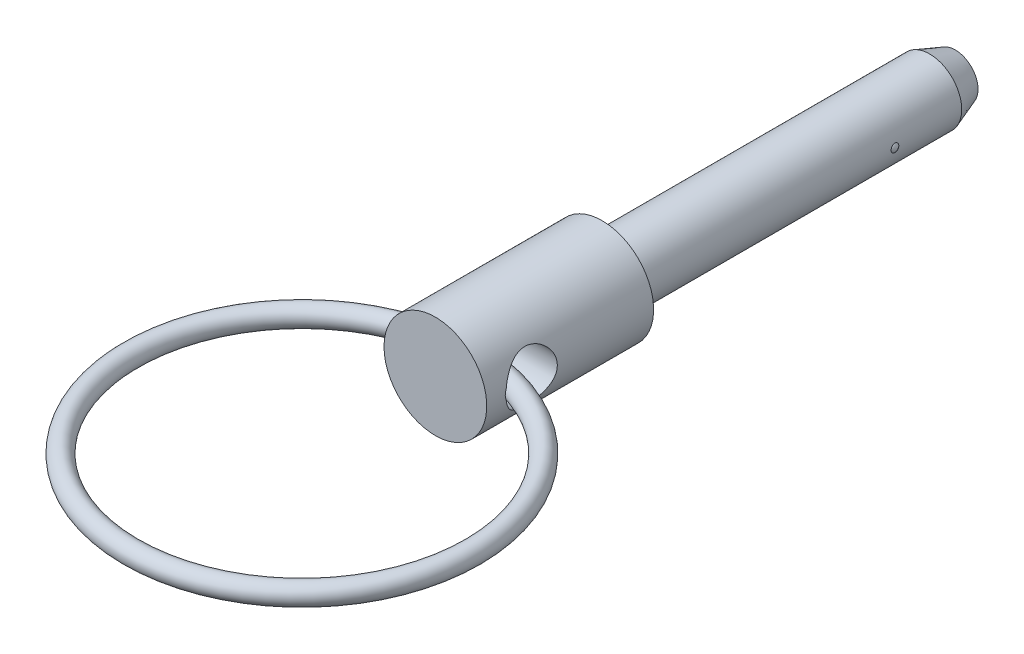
ISO-10303-21;
HEADER;
FILE_DESCRIPTION(('STEP AP214'),'2;1');
FILE_NAME('part.step','',(''),(''),'','','');
FILE_SCHEMA(('AUTOMOTIVE_DESIGN { 1 0 10303 214 1 1 1 1 }'));
ENDSEC;
DATA;
#1=APPLICATION_CONTEXT('core data for automotive mechanical design processes');
#2=APPLICATION_PROTOCOL_DEFINITION('international standard','automotive_design',2000,#1);
#3=PRODUCT_CONTEXT('',#1,'mechanical');
#4=PRODUCT('Part','Part','',(#3));
#5=PRODUCT_RELATED_PRODUCT_CATEGORY('part','',(#4));
#6=PRODUCT_DEFINITION_FORMATION('','',#4);
#7=PRODUCT_DEFINITION_CONTEXT('part definition',#1,'design');
#8=PRODUCT_DEFINITION('design','',#6,#7);
#9=PRODUCT_DEFINITION_SHAPE('','',#8);
#10=(LENGTH_UNIT() NAMED_UNIT(*) SI_UNIT(.MILLI.,.METRE.));
#11=(NAMED_UNIT(*) PLANE_ANGLE_UNIT() SI_UNIT($,.RADIAN.));
#12=(NAMED_UNIT(*) SI_UNIT($,.STERADIAN.) SOLID_ANGLE_UNIT());
#13=UNCERTAINTY_MEASURE_WITH_UNIT(LENGTH_MEASURE(1.E-05),#10,'distance_accuracy_value','');
#14=(GEOMETRIC_REPRESENTATION_CONTEXT(3) GLOBAL_UNCERTAINTY_ASSIGNED_CONTEXT((#13)) GLOBAL_UNIT_ASSIGNED_CONTEXT((#10,
#11,#12)) REPRESENTATION_CONTEXT('',''));
#15=CARTESIAN_POINT('',(0.,0.,0.));
#16=DIRECTION('',(0.,0.,1.));
#17=DIRECTION('',(1.,0.,0.));
#18=AXIS2_PLACEMENT_3D('',#15,#16,#17);
#19=CARTESIAN_POINT('',(0.,0.,14.9758741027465));
#20=DIRECTION('',(0.,0.,1.));
#21=DIRECTION('',(-1.,0.,0.));
#22=AXIS2_PLACEMENT_3D('',#19,#20,#21);
#23=CYLINDRICAL_SURFACE('',#22,4.00000000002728);
#24=CARTESIAN_POINT('',(0.,0.,12.9999999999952));
#25=DIRECTION('',(0.,0.,1.));
#26=DIRECTION('',(-1.,0.,0.));
#27=AXIS2_PLACEMENT_3D('',#24,#25,#26);
#28=CIRCLE('',#27,4.00000000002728);
#29=CARTESIAN_POINT('',(-4.00000000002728,0.,12.9999999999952));
#30=VERTEX_POINT('',#29);
#31=EDGE_CURVE('E68',#30,#30,#28,.T.);
#32=ORIENTED_EDGE('',*,*,#31,.F.);
#33=EDGE_LOOP('',(#32));
#34=FACE_BOUND('',#33,.T.);
#35=CARTESIAN_POINT('',(0.,0.,2.90531487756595E-11));
#36=DIRECTION('',(0.,0.,1.));
#37=DIRECTION('',(-1.,0.,0.));
#38=AXIS2_PLACEMENT_3D('',#35,#36,#37);
#39=CIRCLE('',#38,4.00000000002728);
#40=CARTESIAN_POINT('',(-4.00000000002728,0.,2.90531487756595E-11));
#41=VERTEX_POINT('',#40);
#42=EDGE_CURVE('E119',#41,#41,#39,.T.);
#43=ORIENTED_EDGE('',*,*,#42,.T.);
#44=EDGE_LOOP('',(#43));
#45=FACE_BOUND('',#44,.T.);
#46=CARTESIAN_POINT('',(3.99005038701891,0.281953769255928,9.92986493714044));
#47=CARTESIAN_POINT('',(3.98710361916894,0.323646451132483,9.94537015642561));
#48=CARTESIAN_POINT('',(3.98358785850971,0.364031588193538,9.96435084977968));
#49=CARTESIAN_POINT('',(3.97580260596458,0.441017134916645,10.008790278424));
#50=CARTESIAN_POINT('',(3.97153248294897,0.477614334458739,10.0342544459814));
#51=CARTESIAN_POINT('',(3.96271650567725,0.545954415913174,10.0909789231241));
#52=CARTESIAN_POINT('',(3.95817071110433,0.577698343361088,10.1222379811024));
#53=CARTESIAN_POINT('',(3.94931125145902,0.635450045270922,10.1896824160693));
#54=CARTESIAN_POINT('',(3.94499753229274,0.661459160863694,10.2258666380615));
#55=CARTESIAN_POINT('',(3.93708131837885,0.707055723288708,10.3020868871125));
#56=CARTESIAN_POINT('',(3.93347801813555,0.726650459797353,10.3421184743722));
#57=CARTESIAN_POINT('',(3.92735611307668,0.759043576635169,10.4249158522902));
#58=CARTESIAN_POINT('',(3.92483759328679,0.771841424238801,10.4676818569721));
#59=CARTESIAN_POINT('',(3.92109281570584,0.79064892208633,10.5555243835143));
#60=CARTESIAN_POINT('',(3.91989028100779,0.796534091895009,10.6006284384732));
#61=CARTESIAN_POINT('',(3.91894269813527,0.801182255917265,10.6912124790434));
#62=CARTESIAN_POINT('',(3.91919799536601,0.799943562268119,10.7366925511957));
#63=CARTESIAN_POINT('',(3.92114297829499,0.790356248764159,10.829192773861));
#64=CARTESIAN_POINT('',(3.92290466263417,0.781650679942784,10.8761742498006));
#65=CARTESIAN_POINT('',(3.92772482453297,0.757055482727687,10.9681516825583));
#66=CARTESIAN_POINT('',(3.93078377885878,0.741163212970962,11.0131469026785));
#67=CARTESIAN_POINT('',(3.93806499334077,0.70148030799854,11.1026764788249));
#68=CARTESIAN_POINT('',(3.94234583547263,0.677274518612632,11.1470226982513));
#69=CARTESIAN_POINT('',(3.95147153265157,0.621820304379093,11.2310343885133));
#70=CARTESIAN_POINT('',(3.95631656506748,0.590569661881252,11.2706983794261));
#71=CARTESIAN_POINT('',(3.9660181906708,0.521460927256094,11.3441933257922));
#72=CARTESIAN_POINT('',(3.97087472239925,0.483570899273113,11.3779944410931));
#73=CARTESIAN_POINT('',(3.97994547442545,0.402125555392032,11.4380257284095));
#74=CARTESIAN_POINT('',(3.98416017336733,0.358574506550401,11.4642615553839));
#75=CARTESIAN_POINT('',(3.99101820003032,0.271145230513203,11.5057266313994));
#76=CARTESIAN_POINT('',(3.99376828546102,0.227643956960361,11.5217298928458));
#77=CARTESIAN_POINT('',(3.9978554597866,0.138347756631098,11.5452375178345));
#78=CARTESIAN_POINT('',(3.99919394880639,0.0925551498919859,11.5527503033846));
#79=CARTESIAN_POINT('',(4.00020492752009,0.00564920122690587,11.5584330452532));
#80=CARTESIAN_POINT('',(4.00005022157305,-0.0354012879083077,11.5575719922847));
#81=CARTESIAN_POINT('',(3.99850330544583,-0.116721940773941,11.5488508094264));
#82=CARTESIAN_POINT('',(3.99711125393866,-0.156992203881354,11.5409915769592));
#83=CARTESIAN_POINT('',(3.99330536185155,-0.234470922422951,11.5190218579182));
#84=CARTESIAN_POINT('',(3.99092186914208,-0.271733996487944,11.5050965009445));
#85=CARTESIAN_POINT('',(3.98537855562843,-0.343596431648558,11.4716692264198));
#86=CARTESIAN_POINT('',(3.98221855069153,-0.378195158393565,11.4521659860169));
#87=CARTESIAN_POINT('',(3.97515535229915,-0.446551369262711,11.4066625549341));
#88=CARTESIAN_POINT('',(3.97121432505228,-0.48005403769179,11.380286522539));
#89=CARTESIAN_POINT('',(3.96314004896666,-0.542697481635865,11.3228119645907));
#90=CARTESIAN_POINT('',(3.95900671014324,-0.57183618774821,11.2917112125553));
#91=CARTESIAN_POINT('',(3.95044956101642,-0.628376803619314,11.2218573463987));
#92=CARTESIAN_POINT('',(3.94604615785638,-0.655204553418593,11.1826362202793));
#93=CARTESIAN_POINT('',(3.93791011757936,-0.702452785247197,11.1004353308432));
#94=CARTESIAN_POINT('',(3.93417778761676,-0.72287033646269,11.0574538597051));
#95=CARTESIAN_POINT('',(3.92755557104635,-0.758058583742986,10.9655943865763));
#96=CARTESIAN_POINT('',(3.92474503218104,-0.772320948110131,10.9165145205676));
#97=CARTESIAN_POINT('',(3.92073635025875,-0.792422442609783,10.8165862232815));
#98=CARTESIAN_POINT('',(3.91953811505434,-0.79826205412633,10.765737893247));
#99=CARTESIAN_POINT('',(3.91896964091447,-0.801049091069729,10.6645522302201));
#100=CARTESIAN_POINT('',(3.91957166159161,-0.798131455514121,10.6142190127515));
#101=CARTESIAN_POINT('',(3.92252995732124,-0.783463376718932,10.5149080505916));
#102=CARTESIAN_POINT('',(3.9248854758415,-0.771716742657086,10.4659297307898));
#103=CARTESIAN_POINT('',(3.93088557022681,-0.740520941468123,10.3740211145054));
#104=CARTESIAN_POINT('',(3.93443961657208,-0.721603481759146,10.3309041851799));
#105=CARTESIAN_POINT('',(3.94243966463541,-0.67652841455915,10.2487285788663));
#106=CARTESIAN_POINT('',(3.94688545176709,-0.650372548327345,10.2096689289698));
#107=CARTESIAN_POINT('',(3.95592540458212,-0.592842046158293,10.138445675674));
#108=CARTESIAN_POINT('',(3.96050463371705,-0.561744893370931,10.1060555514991));
#109=CARTESIAN_POINT('',(3.96946431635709,-0.494471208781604,10.0470379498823));
#110=CARTESIAN_POINT('',(3.97384478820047,-0.458295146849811,10.0204099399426));
#111=CARTESIAN_POINT('',(3.98187371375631,-0.382266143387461,9.97385565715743));
#112=CARTESIAN_POINT('',(3.98552868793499,-0.342451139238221,9.95386848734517));
#113=CARTESIAN_POINT('',(3.9917566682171,-0.259975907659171,9.92075319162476));
#114=CARTESIAN_POINT('',(3.99432946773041,-0.217315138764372,9.90762637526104));
#115=CARTESIAN_POINT('',(3.99811926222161,-0.130195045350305,9.88852098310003));
#116=CARTESIAN_POINT('',(3.99933102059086,-0.0857294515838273,9.88257000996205));
#117=CARTESIAN_POINT('',(4.00024701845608,0.00356373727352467,9.87805708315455));
#118=CARTESIAN_POINT('',(3.9999525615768,0.0483909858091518,9.8794887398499));
#119=CARTESIAN_POINT('',(3.99817522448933,0.125082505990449,9.88829599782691));
#120=CARTESIAN_POINT('',(3.99703656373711,0.157163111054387,9.8939529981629));
#121=CARTESIAN_POINT('',(3.99404982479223,0.220379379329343,9.90907748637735));
#122=CARTESIAN_POINT('',(3.9922017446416,0.251515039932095,9.91854498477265));
#123=CARTESIAN_POINT('',(3.99005038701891,0.281953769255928,9.92986493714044));
#124=B_SPLINE_CURVE_WITH_KNOTS('',3,(#46,#47,#48,#49,#50,#51,#52,#53,#54,#55,#56,#57,#58,#59,
#60,#61,#62,#63,#64,#65,#66,#67,#68,#69,#70,#71,#72,#73,#74,#75,#76,#77,#78,#79,#80,#81,#82,#83,
#84,#85,#86,#87,#88,#89,#90,#91,#92,#93,#94,#95,#96,#97,#98,#99,#100,#101,#102,#103,#104,#105,
#106,#107,#108,#109,#110,#111,#112,#113,#114,#115,#116,#117,#118,#119,#120,#121,#122,#123),
.UNSPECIFIED.,.T.,.F.,(4,2,2,2,2,2,2,2,2,2,2,2,2,2,2,2,2,2,2,2,2,2,2,2,2,2,2,2,2,2,2,2,2,2,2,2,
2,2,4),(0.,0.13362272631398,0.267357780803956,0.40106398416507,0.534738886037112,
0.668261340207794,0.801794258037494,0.937696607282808,1.07363115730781,1.2164509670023,
1.35932331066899,1.5107314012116,1.66218722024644,1.81439261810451,1.96648394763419,
2.1049852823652,2.24334911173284,2.36591145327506,2.488458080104,2.60750142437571,
2.72657302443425,2.85451767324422,2.98252280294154,3.12508196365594,3.26770620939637,
3.42053145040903,3.57334795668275,3.72382188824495,3.87423093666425,4.01516707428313,
4.15606933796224,4.29082406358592,4.42556633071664,4.55903651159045,4.69253216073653,
4.82653969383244,4.96043126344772,5.05798542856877,5.15553986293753),.UNSPECIFIED.);
#125=CARTESIAN_POINT('',(3.98515545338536,0.344290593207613,11.4701431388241));
#126=VERTEX_POINT('',#125);
#127=CARTESIAN_POINT('',(3.9851554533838,-0.344290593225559,11.4701431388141));
#128=VERTEX_POINT('',#127);
#129=EDGE_CURVE('E40',#126,#128,#124,.T.);
#130=ORIENTED_EDGE('',*,*,#129,.F.);
#131=CARTESIAN_POINT('',(3.46410161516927,-2.,9.5));
#132=CARTESIAN_POINT('',(3.46411185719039,-1.99999158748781,9.39578679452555));
#133=CARTESIAN_POINT('',(3.46887633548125,-1.99179963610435,9.29143782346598));
#134=CARTESIAN_POINT('',(3.48724701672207,-1.95944672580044,9.08594482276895));
#135=CARTESIAN_POINT('',(3.50087179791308,-1.93525221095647,8.98480799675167));
#136=CARTESIAN_POINT('',(3.53498701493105,-1.87219981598,8.78909684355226));
#137=CARTESIAN_POINT('',(3.55544089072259,-1.83341988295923,8.69449074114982));
#138=CARTESIAN_POINT('',(3.60085327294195,-1.74253507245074,8.51315154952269));
#139=CARTESIAN_POINT('',(3.62581202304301,-1.6904294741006,8.42641888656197));
#140=CARTESIAN_POINT('',(3.679937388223,-1.56933307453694,8.25538855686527));
#141=CARTESIAN_POINT('',(3.70928127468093,-1.49930407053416,8.1718817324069));
#142=CARTESIAN_POINT('',(3.76743965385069,-1.34650761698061,8.01718321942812));
#143=CARTESIAN_POINT('',(3.79625387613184,-1.26373385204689,7.94599767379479));
#144=CARTESIAN_POINT('',(3.8524295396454,-1.080979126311,7.81326569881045));
#145=CARTESIAN_POINT('',(3.879562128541,-0.980214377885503,7.75269246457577));
#146=CARTESIAN_POINT('',(3.92701512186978,-0.768314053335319,7.64971829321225));
#147=CARTESIAN_POINT('',(3.94733982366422,-0.657185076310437,7.60730588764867));
#148=CARTESIAN_POINT('',(3.97760922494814,-0.436089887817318,7.54499067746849));
#149=CARTESIAN_POINT('',(3.98818960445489,-0.326603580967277,7.52370094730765));
#150=CARTESIAN_POINT('',(4.00015167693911,-0.105141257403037,7.49966776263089));
#151=CARTESIAN_POINT('',(4.00153893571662,0.00683321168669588,7.49691308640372));
#152=CARTESIAN_POINT('',(3.99525963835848,0.21966504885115,7.50949334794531));
#153=CARTESIAN_POINT('',(3.98836991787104,0.320642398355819,7.5232760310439));
#154=CARTESIAN_POINT('',(3.96748490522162,0.51862754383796,7.56576168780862));
#155=CARTESIAN_POINT('',(3.95348908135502,0.615635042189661,7.59446577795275));
#156=CARTESIAN_POINT('',(3.91943166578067,0.804618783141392,7.66616513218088));
#157=CARTESIAN_POINT('',(3.89928883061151,0.896506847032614,7.70935262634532));
#158=CARTESIAN_POINT('',(3.85475291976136,1.07195360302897,7.80852683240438));
#159=CARTESIAN_POINT('',(3.83035832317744,1.15550929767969,7.86451812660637));
#160=CARTESIAN_POINT('',(3.77688788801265,1.32034732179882,7.99379070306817));
#161=CARTESIAN_POINT('',(3.74758751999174,1.40066815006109,8.06820605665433));
#162=CARTESIAN_POINT('',(3.68908681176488,1.54820874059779,8.22917944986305));
#163=CARTESIAN_POINT('',(3.65988656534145,1.6154184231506,8.31574674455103));
#164=CARTESIAN_POINT('',(3.60288312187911,1.73901066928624,8.50529638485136));
#165=CARTESIAN_POINT('',(3.57528639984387,1.79443462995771,8.60897204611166));
#166=CARTESIAN_POINT('',(3.52750900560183,1.88663822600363,8.82587534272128));
#167=CARTESIAN_POINT('',(3.50732060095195,1.92343731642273,8.9390928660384));
#168=CARTESIAN_POINT('',(3.47889271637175,1.97436042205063,9.1624290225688));
#169=CARTESIAN_POINT('',(3.46983311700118,1.99005024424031,9.27208223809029));
#170=CARTESIAN_POINT('',(3.46235838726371,2.00303389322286,9.49280268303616));
#171=CARTESIAN_POINT('',(3.46393573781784,2.00034071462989,9.60386885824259));
#172=CARTESIAN_POINT('',(3.47668673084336,1.97807208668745,9.81130783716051));
#173=CARTESIAN_POINT('',(3.48679175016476,1.96037563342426,9.90795890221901));
#174=CARTESIAN_POINT('',(3.51388043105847,1.91139256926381,10.0967355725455));
#175=CARTESIAN_POINT('',(3.5308663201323,1.88010155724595,10.1888597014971));
#176=CARTESIAN_POINT('',(3.57072444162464,1.80329517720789,10.370822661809));
#177=CARTESIAN_POINT('',(3.59383286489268,1.75718812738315,10.46035803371));
#178=CARTESIAN_POINT('',(3.64312238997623,1.65257412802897,10.6309385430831));
#179=CARTESIAN_POINT('',(3.66930506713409,1.59406080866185,10.7119792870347));
#180=CARTESIAN_POINT('',(3.72575996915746,1.45767433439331,10.8739575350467));
#181=CARTESIAN_POINT('',(3.75613166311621,1.37829054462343,10.9535943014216));
#182=CARTESIAN_POINT('',(3.81468469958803,1.20680899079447,11.0988244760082));
#183=CARTESIAN_POINT('',(3.84286530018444,1.11470694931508,11.1644131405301));
#184=CARTESIAN_POINT('',(3.89482723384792,0.917070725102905,11.2811474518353));
#185=CARTESIAN_POINT('',(3.91847283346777,0.811246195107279,11.3318662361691));
#186=CARTESIAN_POINT('',(3.95766709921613,0.591044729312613,11.4142758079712));
#187=CARTESIAN_POINT('',(3.97322287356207,0.476675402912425,11.4459833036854));
#188=CARTESIAN_POINT('',(3.99335016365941,0.253959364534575,11.4867371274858));
#189=CARTESIAN_POINT('',(3.99879855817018,0.146022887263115,11.4975957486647));
#190=CARTESIAN_POINT('',(4.00084260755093,-0.0702519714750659,11.5016865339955));
#191=CARTESIAN_POINT('',(3.99744136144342,-0.178590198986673,11.4949248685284));
#192=CARTESIAN_POINT('',(3.98267937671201,-0.385075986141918,11.4651671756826));
#193=CARTESIAN_POINT('',(3.97185789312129,-0.483424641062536,11.4432702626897));
#194=CARTESIAN_POINT('',(3.94384187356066,-0.674891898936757,11.3853460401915));
#195=CARTESIAN_POINT('',(3.92664642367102,-0.768009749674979,11.3493167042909));
#196=CARTESIAN_POINT('',(3.88651861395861,-0.950846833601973,11.2625457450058));
#197=CARTESIAN_POINT('',(3.86337234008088,-1.04025036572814,11.211240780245));
#198=CARTESIAN_POINT('',(3.81376266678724,-1.20954920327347,11.096084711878));
#199=CARTESIAN_POINT('',(3.78729774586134,-1.28944011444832,11.0322278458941));
#200=CARTESIAN_POINT('',(3.73057218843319,-1.44582833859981,10.8864033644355));
#201=CARTESIAN_POINT('',(3.70019591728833,-1.52119665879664,10.8032658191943));
#202=CARTESIAN_POINT('',(3.64126158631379,-1.65732528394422,10.6251077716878));
#203=CARTESIAN_POINT('',(3.6127051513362,-1.71807266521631,10.530076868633));
#204=CARTESIAN_POINT('',(3.55999186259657,-1.82486714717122,10.3266911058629));
#205=CARTESIAN_POINT('',(3.5360025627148,-1.8703890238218,10.2180100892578));
#206=CARTESIAN_POINT('',(3.50696218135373,-1.92395929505,10.0494218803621));
#207=CARTESIAN_POINT('',(3.49844389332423,-1.93935666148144,9.99235217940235));
#208=CARTESIAN_POINT('',(3.48406059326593,-1.96508069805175,9.87676744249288));
#209=CARTESIAN_POINT('',(3.47819372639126,-1.97541091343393,9.81825344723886));
#210=CARTESIAN_POINT('',(3.47059023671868,-1.9887293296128,9.71639921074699));
#211=CARTESIAN_POINT('',(3.46816389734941,-1.99295091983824,9.67326694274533));
#212=CARTESIAN_POINT('',(3.46491740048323,-1.99858810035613,9.5867643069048));
#213=CARTESIAN_POINT('',(3.46409735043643,-2.00000350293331,9.54339392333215));
#214=CARTESIAN_POINT('',(3.46410161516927,-2.,9.5));
#215=B_SPLINE_CURVE_WITH_KNOTS('',3,(#131,#132,#133,#134,#135,#136,#137,#138,#139,#140,#141,
#142,#143,#144,#145,#146,#147,#148,#149,#150,#151,#152,#153,#154,#155,#156,#157,#158,#159,#160,
#161,#162,#163,#164,#165,#166,#167,#168,#169,#170,#171,#172,#173,#174,#175,#176,#177,#178,#179,
#180,#181,#182,#183,#184,#185,#186,#187,#188,#189,#190,#191,#192,#193,#194,#195,#196,#197,#198,
#199,#200,#201,#202,#203,#204,#205,#206,#207,#208,#209,#210,#211,#212,#213,#214),.UNSPECIFIED.,
.T.,.F.,(4,2,2,2,2,2,2,2,2,2,2,2,2,2,2,2,2,2,2,2,2,2,2,2,2,2,2,2,2,2,2,2,2,2,2,2,2,2,2,2,2,4),
(0.,0.312464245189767,0.625585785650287,0.937057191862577,1.24854545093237,1.58572462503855,
1.92307142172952,2.283157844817,2.64301653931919,2.97726969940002,3.31132047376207,
3.61632194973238,3.92134625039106,4.23059069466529,4.53994598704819,4.87854382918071,
5.21740096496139,5.57777683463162,5.93777548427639,6.26924581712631,6.60048186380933,
6.89548366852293,7.19058104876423,7.49934592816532,7.80826972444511,8.15613487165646,
8.50411729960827,8.8612836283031,9.21813559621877,9.54224540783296,9.86624173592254,
10.1688884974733,10.4715786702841,10.7872150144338,11.1029966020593,11.4502048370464,
11.7977188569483,12.1562149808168,12.3351395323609,12.513938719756,12.6440387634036,
12.7741475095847),.UNSPECIFIED.);
#216=EDGE_CURVE('E52',#128,#126,#215,.T.);
#217=ORIENTED_EDGE('',*,*,#216,.F.);
#218=EDGE_LOOP('',(#130,#217));
#219=FACE_BOUND('',#218,.T.);
#220=CARTESIAN_POINT('',(-3.99005038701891,0.281953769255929,9.92986493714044));
#221=CARTESIAN_POINT('',(-3.99300741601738,0.240095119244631,9.91430139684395));
#222=CARTESIAN_POINT('',(-3.99539394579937,0.196873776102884,9.90222423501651));
#223=CARTESIAN_POINT('',(-3.99875840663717,0.10894998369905,9.88535960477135));
#224=CARTESIAN_POINT('',(-3.99973502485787,0.0642461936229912,9.88057893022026));
#225=CARTESIAN_POINT('',(-4.00017032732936,-0.0253314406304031,9.87843698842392));
#226=CARTESIAN_POINT('',(-3.99962961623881,-0.070205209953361,9.88107276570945));
#227=CARTESIAN_POINT('',(-3.99709040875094,-0.158855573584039,9.89369477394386));
#228=CARTESIAN_POINT('',(-3.99509218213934,-0.202632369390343,9.90367964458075));
#229=CARTESIAN_POINT('',(-3.9898570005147,-0.287863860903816,9.93075746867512));
#230=CARTESIAN_POINT('',(-3.98661975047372,-0.329318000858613,9.94785211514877));
#231=CARTESIAN_POINT('',(-3.97926488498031,-0.408707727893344,9.98872052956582));
#232=CARTESIAN_POINT('',(-3.97514726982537,-0.446643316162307,10.0124942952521));
#233=CARTESIAN_POINT('',(-3.96650501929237,-0.517804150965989,10.0660180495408));
#234=CARTESIAN_POINT('',(-3.96198162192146,-0.551042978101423,10.0957501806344));
#235=CARTESIAN_POINT('',(-3.95302385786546,-0.612008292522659,10.1604189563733));
#236=CARTESIAN_POINT('',(-3.94858948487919,-0.639735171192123,10.1953552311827));
#237=CARTESIAN_POINT('',(-3.94031345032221,-0.688877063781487,10.2693392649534));
#238=CARTESIAN_POINT('',(-3.93647024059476,-0.710308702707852,10.3083758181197));
#239=CARTESIAN_POINT('',(-3.92977370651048,-0.746470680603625,10.3895111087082));
#240=CARTESIAN_POINT('',(-3.92692040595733,-0.761200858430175,10.4316099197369));
#241=CARTESIAN_POINT('',(-3.92245555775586,-0.783887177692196,10.5182713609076));
#242=CARTESIAN_POINT('',(-3.92086162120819,-0.791747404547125,10.5628599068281));
#243=CARTESIAN_POINT('',(-3.91911143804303,-0.800365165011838,10.652740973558));
#244=CARTESIAN_POINT('',(-3.91895550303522,-0.801121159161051,10.698033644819));
#245=CARTESIAN_POINT('',(-3.92007796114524,-0.795611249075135,10.7902748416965));
#246=CARTESIAN_POINT('',(-3.92142316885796,-0.789018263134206,10.837202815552));
#247=CARTESIAN_POINT('',(-3.92546548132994,-0.768652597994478,10.9294151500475));
#248=CARTESIAN_POINT('',(-3.92816306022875,-0.754877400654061,10.9746989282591));
#249=CARTESIAN_POINT('',(-3.93479992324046,-0.719508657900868,11.0652695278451));
#250=CARTESIAN_POINT('',(-3.93880557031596,-0.697485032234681,11.1103840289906));
#251=CARTESIAN_POINT('',(-3.94752061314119,-0.646337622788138,11.196342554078));
#252=CARTESIAN_POINT('',(-3.95223026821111,-0.617211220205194,11.2371849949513));
#253=CARTESIAN_POINT('',(-3.96188534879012,-0.551879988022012,11.3139586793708));
#254=CARTESIAN_POINT('',(-3.96683340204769,-0.515564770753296,11.349796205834));
#255=CARTESIAN_POINT('',(-3.97625988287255,-0.436941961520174,11.414255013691));
#256=CARTESIAN_POINT('',(-3.98073857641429,-0.39463779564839,11.4428803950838));
#257=CARTESIAN_POINT('',(-3.98829005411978,-0.308636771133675,11.4895001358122));
#258=CARTESIAN_POINT('',(-3.99144495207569,-0.265302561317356,11.5081469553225));
#259=CARTESIAN_POINT('',(-3.99638413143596,-0.175817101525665,11.5368761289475));
#260=CARTESIAN_POINT('',(-3.99816989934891,-0.129668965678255,11.5469677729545));
#261=CARTESIAN_POINT('',(-3.99999419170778,-0.0417967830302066,11.5572584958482));
#262=CARTESIAN_POINT('',(-4.00021432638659,-0.000194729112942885,11.5584860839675));
#263=CARTESIAN_POINT('',(-3.99936155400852,0.0825703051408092,11.5536924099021));
#264=CARTESIAN_POINT('',(-3.9982889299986,0.123733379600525,11.5476727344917));
#265=CARTESIAN_POINT('',(-3.99505363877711,0.202575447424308,11.5291543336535));
#266=CARTESIAN_POINT('',(-3.99294152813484,0.240327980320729,11.5169554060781));
#267=CARTESIAN_POINT('',(-3.98787194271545,0.313401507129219,11.4868260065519));
#268=CARTESIAN_POINT('',(-3.98491430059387,0.348722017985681,11.4688943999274));
#269=CARTESIAN_POINT('',(-3.97822434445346,0.418368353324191,11.4267056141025));
#270=CARTESIAN_POINT('',(-3.9744550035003,0.452491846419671,11.4021214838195));
#271=CARTESIAN_POINT('',(-3.96662805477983,0.516631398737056,11.3481231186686));
#272=CARTESIAN_POINT('',(-3.96257031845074,0.54664560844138,11.3187067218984));
#273=CARTESIAN_POINT('',(-3.9540631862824,0.605276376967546,11.2522992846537));
#274=CARTESIAN_POINT('',(-3.94962143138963,0.633350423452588,11.214827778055));
#275=CARTESIAN_POINT('',(-3.9412701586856,0.68339933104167,11.135950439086));
#276=CARTESIAN_POINT('',(-3.93736090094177,0.705371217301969,11.0945427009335));
#277=CARTESIAN_POINT('',(-3.93019522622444,0.744305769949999,11.0052774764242));
#278=CARTESIAN_POINT('',(-3.9270182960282,0.760712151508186,10.9571694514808));
#279=CARTESIAN_POINT('',(-3.92216984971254,0.785329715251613,10.8588172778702));
#280=CARTESIAN_POINT('',(-3.92049838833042,0.793540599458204,10.8085730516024));
#281=CARTESIAN_POINT('',(-3.91892501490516,0.801276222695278,10.7075574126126));
#282=CARTESIAN_POINT('',(-3.91901674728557,0.800832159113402,10.6567885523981));
#283=CARTESIAN_POINT('',(-3.92100845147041,0.791023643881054,10.5561554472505));
#284=CARTESIAN_POINT('',(-3.9229076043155,0.781663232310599,10.5062908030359));
#285=CARTESIAN_POINT('',(-3.9281461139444,0.754877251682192,10.4121456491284));
#286=CARTESIAN_POINT('',(-3.93139064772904,0.737977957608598,10.3677100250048));
#287=CARTESIAN_POINT('',(-3.93892368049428,0.696648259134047,10.2825763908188));
#288=CARTESIAN_POINT('',(-3.94321208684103,0.672218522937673,10.2418780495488));
#289=CARTESIAN_POINT('',(-3.95208501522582,0.617853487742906,10.1674080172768));
#290=CARTESIAN_POINT('',(-3.95664517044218,0.588241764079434,10.1333964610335));
#291=CARTESIAN_POINT('',(-3.96570971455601,0.523645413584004,10.0709664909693));
#292=CARTESIAN_POINT('',(-3.97021415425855,0.488666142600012,10.0425425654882));
#293=CARTESIAN_POINT('',(-3.97742706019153,0.425180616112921,9.99940040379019));
#294=CARTESIAN_POINT('',(-3.9802769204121,0.397749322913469,9.98310007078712));
#295=CARTESIAN_POINT('',(-3.98553180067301,0.341095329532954,9.95389443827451));
#296=CARTESIAN_POINT('',(-3.9879368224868,0.311872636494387,9.94098912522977));
#297=CARTESIAN_POINT('',(-3.99005038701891,0.281953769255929,9.92986493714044));
#298=B_SPLINE_CURVE_WITH_KNOTS('',3,(#220,#221,#222,#223,#224,#225,#226,#227,#228,#229,#230,
#231,#232,#233,#234,#235,#236,#237,#238,#239,#240,#241,#242,#243,#244,#245,#246,#247,#248,#249,
#250,#251,#252,#253,#254,#255,#256,#257,#258,#259,#260,#261,#262,#263,#264,#265,#266,#267,#268,
#269,#270,#271,#272,#273,#274,#275,#276,#277,#278,#279,#280,#281,#282,#283,#284,#285,#286,#287,
#288,#289,#290,#291,#292,#293,#294,#295,#296,#297),.UNSPECIFIED.,.T.,.F.,(4,2,2,2,2,2,2,2,2,2,2,
2,2,2,2,2,2,2,2,2,2,2,2,2,2,2,2,2,2,2,2,2,2,2,2,2,2,2,4),(0.,0.134152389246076,
0.268429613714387,0.402653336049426,0.536852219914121,0.671083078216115,0.805313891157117,
0.939148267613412,1.07297313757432,1.20644134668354,1.33991276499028,1.4752191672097,
1.61055488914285,1.75216328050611,1.89382135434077,2.04422271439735,2.19467961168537,
2.34765655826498,2.50054634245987,2.64157513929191,2.78245059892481,2.90667081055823,
3.03086382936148,3.14953805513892,3.26823578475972,3.39440010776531,3.52062102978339,
3.66112536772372,3.80169808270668,3.95376166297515,4.10583077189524,4.25735183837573,
4.4088042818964,4.55102684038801,4.6932367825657,4.82856596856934,4.96376098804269,
5.05964806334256,5.15553475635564),.UNSPECIFIED.);
#299=CARTESIAN_POINT('',(-3.98515545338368,-0.344290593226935,11.4701431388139));
#300=VERTEX_POINT('',#299);
#301=CARTESIAN_POINT('',(-3.98515545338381,0.344290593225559,11.4701431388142));
#302=VERTEX_POINT('',#301);
#303=EDGE_CURVE('E56',#300,#302,#298,.T.);
#304=ORIENTED_EDGE('',*,*,#303,.F.);
#305=CARTESIAN_POINT('',(-4.00000000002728,0.,7.5));
#306=CARTESIAN_POINT('',(-3.9999942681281,-0.105143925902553,7.50000660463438));
#307=CARTESIAN_POINT('',(-3.99580982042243,-0.2104131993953,7.50834014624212));
#308=CARTESIAN_POINT('',(-3.97948312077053,-0.417840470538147,7.54130576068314));
#309=CARTESIAN_POINT('',(-3.96732575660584,-0.519992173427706,7.56596878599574));
#310=CARTESIAN_POINT('',(-3.93632558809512,-0.717867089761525,7.63038761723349));
#311=CARTESIAN_POINT('',(-3.91750878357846,-0.81361360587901,7.67008476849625));
#312=CARTESIAN_POINT('',(-3.87491553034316,-0.996945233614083,7.76314124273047));
#313=CARTESIAN_POINT('',(-3.85113947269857,-1.08453098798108,7.81649948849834));
#314=CARTESIAN_POINT('',(-3.79912516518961,-1.25501563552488,7.93903449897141));
#315=CARTESIAN_POINT('',(-3.7707039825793,-1.33731042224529,8.00897295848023));
#316=CARTESIAN_POINT('',(-3.71319940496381,-1.48955888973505,8.16104295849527));
#317=CARTESIAN_POINT('',(-3.68411552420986,-1.55950316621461,8.24318370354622));
#318=CARTESIAN_POINT('',(-3.6259790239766,-1.6905040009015,8.42496669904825));
#319=CARTESIAN_POINT('',(-3.59710373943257,-1.75045067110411,8.52547219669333));
#320=CARTESIAN_POINT('',(-3.54571957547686,-1.852336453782,8.73673467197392));
#321=CARTESIAN_POINT('',(-3.5232061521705,-1.89428842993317,8.84748425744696));
#322=CARTESIAN_POINT('',(-3.48915734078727,-1.95626488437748,9.06933021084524));
#323=CARTESIAN_POINT('',(-3.47704543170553,-1.9774517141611,9.18000890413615));
#324=CARTESIAN_POINT('',(-3.46363779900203,-2.00085398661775,9.40395767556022));
#325=CARTESIAN_POINT('',(-3.46233138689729,-2.00308817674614,9.51722508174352));
#326=CARTESIAN_POINT('',(-3.4702186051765,-1.98937457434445,9.72857204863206));
#327=CARTESIAN_POINT('',(-3.47817527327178,-1.97556911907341,9.82684806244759));
#328=CARTESIAN_POINT('',(-3.50152457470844,-1.93387969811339,10.0194438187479));
#329=CARTESIAN_POINT('',(-3.51691957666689,-1.90599124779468,10.1137622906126));
#330=CARTESIAN_POINT('',(-3.55374952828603,-1.83641956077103,10.2984582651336));
#331=CARTESIAN_POINT('',(-3.57531681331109,-1.79443013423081,10.388692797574));
#332=CARTESIAN_POINT('',(-3.62206808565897,-1.69808337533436,10.5612685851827));
#333=CARTESIAN_POINT('',(-3.64725369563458,-1.64372048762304,10.6436062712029));
#334=CARTESIAN_POINT('',(-3.70226315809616,-1.51613210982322,10.8090425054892));
#335=CARTESIAN_POINT('',(-3.73227020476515,-1.441388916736,10.890913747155));
#336=CARTESIAN_POINT('',(-3.79095246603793,-1.2791111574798,11.0414708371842));
#337=CARTESIAN_POINT('',(-3.81962703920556,-1.19157051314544,11.1101503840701));
#338=CARTESIAN_POINT('',(-3.87403974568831,-1.00103301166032,11.2353713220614));
#339=CARTESIAN_POINT('',(-3.89957968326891,-0.897507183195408,11.2912009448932));
#340=CARTESIAN_POINT('',(-3.94315762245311,-0.680932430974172,11.3841940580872));
#341=CARTESIAN_POINT('',(-3.96120157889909,-0.567891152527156,11.4213723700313));
#342=CARTESIAN_POINT('',(-3.98648667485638,-0.345532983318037,11.4729508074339));
#343=CARTESIAN_POINT('',(-3.99449876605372,-0.236683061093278,11.488982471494));
#344=CARTESIAN_POINT('',(-4.00146026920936,-0.0175591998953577,11.502929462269));
#345=CARTESIAN_POINT('',(-4.00041397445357,0.0927140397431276,11.5008533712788));
#346=CARTESIAN_POINT('',(-3.98982384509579,0.302465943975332,11.479586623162));
#347=CARTESIAN_POINT('',(-3.98094491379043,0.402118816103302,11.4617349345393));
#348=CARTESIAN_POINT('',(-3.95644342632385,0.596813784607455,11.4115238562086));
#349=CARTESIAN_POINT('',(-3.94082012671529,0.691855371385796,11.3791628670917));
#350=CARTESIAN_POINT('',(-3.90368502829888,0.877777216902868,11.3000030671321));
#351=CARTESIAN_POINT('',(-3.88201763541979,0.968460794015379,11.2528178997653));
#352=CARTESIAN_POINT('',(-3.83487948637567,1.14092272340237,11.1457849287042));
#353=CARTESIAN_POINT('',(-3.80940711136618,1.22269725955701,11.0859317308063));
#354=CARTESIAN_POINT('',(-3.75416442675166,1.38353537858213,10.948479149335));
#355=CARTESIAN_POINT('',(-3.72421769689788,1.46154415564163,10.8697142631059));
#356=CARTESIAN_POINT('',(-3.66524783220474,1.60371264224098,10.7001496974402));
#357=CARTESIAN_POINT('',(-3.63622534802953,1.66786277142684,10.6093417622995));
#358=CARTESIAN_POINT('',(-3.58102384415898,1.7834158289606,10.412712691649));
#359=CARTESIAN_POINT('',(-3.55505059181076,1.83405099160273,10.306377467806));
#360=CARTESIAN_POINT('',(-3.51148144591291,1.91616565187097,10.0849798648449));
#361=CARTESIAN_POINT('',(-3.49387476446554,1.94766983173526,9.96992894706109));
#362=CARTESIAN_POINT('',(-3.47123002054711,1.98772337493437,9.74617955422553));
#363=CARTESIAN_POINT('',(-3.46514766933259,1.99818599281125,9.6379314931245));
#364=CARTESIAN_POINT('',(-3.46330709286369,2.00137830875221,9.42110586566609));
#365=CARTESIAN_POINT('',(-3.46754439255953,1.99411569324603,9.31252846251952));
#366=CARTESIAN_POINT('',(-3.48475724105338,1.96385225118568,9.10903299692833));
#367=CARTESIAN_POINT('',(-3.49686188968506,1.94241662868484,9.01379905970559));
#368=CARTESIAN_POINT('',(-3.52742032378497,1.88635071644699,8.8283837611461));
#369=CARTESIAN_POINT('',(-3.54587615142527,1.85171618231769,8.73820403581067));
#370=CARTESIAN_POINT('',(-3.58857060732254,1.76763149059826,8.55875029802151));
#371=CARTESIAN_POINT('',(-3.61311444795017,1.71734227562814,8.46994419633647));
#372=CARTESIAN_POINT('',(-3.66470663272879,1.60430194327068,8.30145092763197));
#373=CARTESIAN_POINT('',(-3.69175627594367,1.54154434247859,8.22176853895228));
#374=CARTESIAN_POINT('',(-3.74924646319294,1.3964066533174,8.06371603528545));
#375=CARTESIAN_POINT('',(-3.77969966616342,1.31256884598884,7.98668179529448));
#376=CARTESIAN_POINT('',(-3.83755504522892,1.13230961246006,7.84747403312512));
#377=CARTESIAN_POINT('',(-3.86495557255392,1.03588144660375,7.78530852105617));
#378=CARTESIAN_POINT('',(-3.91396019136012,0.831863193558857,7.67752727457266));
#379=CARTESIAN_POINT('',(-3.93552192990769,0.724199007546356,7.63203166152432));
#380=CARTESIAN_POINT('',(-3.97002682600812,0.501484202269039,7.56038366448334));
#381=CARTESIAN_POINT('',(-3.98299446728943,0.386455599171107,7.53417630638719));
#382=CARTESIAN_POINT('',(-3.9939092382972,0.225203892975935,7.51220517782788));
#383=CARTESIAN_POINT('',(-3.99618730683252,0.180323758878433,7.50763471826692));
#384=CARTESIAN_POINT('',(-3.99923393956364,0.0903034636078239,7.50153066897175));
#385=CARTESIAN_POINT('',(-4.0000024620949,0.0451632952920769,7.49999716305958));
#386=CARTESIAN_POINT('',(-4.00000000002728,0.,7.5));
#387=B_SPLINE_CURVE_WITH_KNOTS('',3,(#305,#306,#307,#308,#309,#310,#311,#312,#313,#314,#315,
#316,#317,#318,#319,#320,#321,#322,#323,#324,#325,#326,#327,#328,#329,#330,#331,#332,#333,#334,
#335,#336,#337,#338,#339,#340,#341,#342,#343,#344,#345,#346,#347,#348,#349,#350,#351,#352,#353,
#354,#355,#356,#357,#358,#359,#360,#361,#362,#363,#364,#365,#366,#367,#368,#369,#370,#371,#372,
#373,#374,#375,#376,#377,#378,#379,#380,#381,#382,#383,#384,#385,#386),.UNSPECIFIED.,.T.,.F.,(4,
2,2,2,2,2,2,2,2,2,2,2,2,2,2,2,2,2,2,2,2,2,2,2,2,2,2,2,2,2,2,2,2,2,2,2,2,2,2,2,4),(0.,
0.315248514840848,0.631096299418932,0.945724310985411,1.26032752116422,1.59396351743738,
1.92785247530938,2.28763452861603,2.64715895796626,2.98516024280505,3.3228271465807,
3.62011424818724,3.91749607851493,4.22180480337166,4.52625042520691,4.86929882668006,
5.21251069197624,5.57166044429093,5.93052433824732,6.25966580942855,6.58865129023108,
6.89213813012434,7.19565843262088,7.50785712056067,7.82018901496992,8.16319221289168,
8.5064317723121,8.86629364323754,9.22569023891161,9.55058615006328,9.87534119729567,
10.1691586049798,10.4630705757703,10.7767291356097,11.0905512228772,11.4425048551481,
11.7946476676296,12.1492802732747,12.5028981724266,12.6383056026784,12.7737167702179),.UNSPECIFIED.);
#388=EDGE_CURVE('E59',#302,#300,#387,.T.);
#389=ORIENTED_EDGE('',*,*,#388,.F.);
#390=EDGE_LOOP('',(#304,#389));
#391=FACE_BOUND('',#390,.T.);
#392=ADVANCED_FACE('F14',(#34,#45,#219,#391),#23,.T.);
#393=CARTESIAN_POINT('',(5.,0.,9.5));
#394=DIRECTION('',(-1.,0.,0.));
#395=DIRECTION('',(0.,-1.,0.));
#396=AXIS2_PLACEMENT_3D('',#393,#394,#395);
#397=CYLINDRICAL_SURFACE('',#396,2.);
#398=ORIENTED_EDGE('',*,*,#388,.T.);
#399=CARTESIAN_POINT('',(-4.01108315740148,-0.369511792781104,11.4655688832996));
#400=CARTESIAN_POINT('',(-3.99021138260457,-0.350083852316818,11.4692147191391));
#401=CARTESIAN_POINT('',(-3.97024619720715,-0.329516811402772,11.4727888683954));
#402=CARTESIAN_POINT('',(-3.93275440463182,-0.285678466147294,11.4796199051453));
#403=CARTESIAN_POINT('',(-3.91527020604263,-0.262370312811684,11.4828710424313));
#404=CARTESIAN_POINT('',(-3.88395406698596,-0.213038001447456,11.4887768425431));
#405=CARTESIAN_POINT('',(-3.87014971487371,-0.186995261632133,11.4914269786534));
#406=CARTESIAN_POINT('',(-3.84773626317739,-0.132819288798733,11.4957673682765));
#407=CARTESIAN_POINT('',(-3.83909292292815,-0.104701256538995,11.4974639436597));
#408=CARTESIAN_POINT('',(-3.82934402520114,-0.054244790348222,11.4993828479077));
#409=CARTESIAN_POINT('',(-3.8269137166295,-0.0321704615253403,11.499863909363));
#410=CARTESIAN_POINT('',(-3.82579163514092,0.0120958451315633,11.500085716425));
#411=CARTESIAN_POINT('',(-3.82710196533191,0.0342878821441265,11.4998260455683));
#412=CARTESIAN_POINT('',(-3.83333881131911,0.0780566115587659,11.498595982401));
#413=CARTESIAN_POINT('',(-3.83825432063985,0.0996349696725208,11.4976277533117));
#414=CARTESIAN_POINT('',(-3.8512832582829,0.141760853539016,11.4950816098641));
#415=CARTESIAN_POINT('',(-3.85939921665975,0.162307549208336,11.4935032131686));
#416=CARTESIAN_POINT('',(-3.88251041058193,0.210921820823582,11.489056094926));
#417=CARTESIAN_POINT('',(-3.89895987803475,0.238271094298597,11.4859257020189));
#418=CARTESIAN_POINT('',(-3.93589373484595,0.289965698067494,11.4790416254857));
#419=CARTESIAN_POINT('',(-3.95638428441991,0.314306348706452,11.4752869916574));
#420=CARTESIAN_POINT('',(-3.98891907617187,0.348315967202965,11.4694667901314));
#421=CARTESIAN_POINT('',(-3.99986593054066,0.359074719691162,11.467529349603));
#422=CARTESIAN_POINT('',(-4.01108315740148,0.369511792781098,11.4655688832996));
#423=B_SPLINE_CURVE_WITH_KNOTS('',3,(#399,#400,#401,#402,#403,#404,#405,#406,#407,#408,#409,
#410,#411,#412,#413,#414,#415,#416,#417,#418,#419,#420,#421,#422),.UNSPECIFIED.,.F.,.F.,(4,2,2,
2,2,2,2,2,2,2,2,4),(0.,0.0863607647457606,0.174054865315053,0.262389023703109,0.350130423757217,
0.416459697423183,0.482826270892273,0.548991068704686,0.615208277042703,0.710869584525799,
0.806677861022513,0.85304943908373),.UNSPECIFIED.);
#424=EDGE_CURVE('E33',#300,#302,#423,.T.);
#425=ORIENTED_EDGE('',*,*,#424,.T.);
#426=EDGE_LOOP('',(#398,#425));
#427=FACE_BOUND('',#426,.T.);
#428=ORIENTED_EDGE('',*,*,#216,.T.);
#429=CARTESIAN_POINT('',(4.01108315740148,0.369511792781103,11.4655688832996));
#430=CARTESIAN_POINT('',(3.99021138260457,0.350083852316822,11.4692147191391));
#431=CARTESIAN_POINT('',(3.97024619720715,0.329516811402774,11.4727888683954));
#432=CARTESIAN_POINT('',(3.93275440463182,0.285678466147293,11.4796199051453));
#433=CARTESIAN_POINT('',(3.91527020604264,0.26237031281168,11.4828710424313));
#434=CARTESIAN_POINT('',(3.88395406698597,0.213038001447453,11.4887768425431));
#435=CARTESIAN_POINT('',(3.87014971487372,0.186995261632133,11.4914269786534));
#436=CARTESIAN_POINT('',(3.84773626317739,0.132819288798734,11.4957673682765));
#437=CARTESIAN_POINT('',(3.83909292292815,0.104701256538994,11.4974639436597));
#438=CARTESIAN_POINT('',(3.82934402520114,0.05424479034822,11.4993828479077));
#439=CARTESIAN_POINT('',(3.8269137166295,0.0321704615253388,11.499863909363));
#440=CARTESIAN_POINT('',(3.82579163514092,-0.0120958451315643,11.500085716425));
#441=CARTESIAN_POINT('',(3.82710196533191,-0.0342878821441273,11.4998260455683));
#442=CARTESIAN_POINT('',(3.83333881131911,-0.0780566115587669,11.498595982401));
#443=CARTESIAN_POINT('',(3.83825432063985,-0.0996349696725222,11.4976277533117));
#444=CARTESIAN_POINT('',(3.85128325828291,-0.141760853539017,11.4950816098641));
#445=CARTESIAN_POINT('',(3.85939921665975,-0.162307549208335,11.4935032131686));
#446=CARTESIAN_POINT('',(3.88251041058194,-0.210921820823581,11.489056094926));
#447=CARTESIAN_POINT('',(3.89895987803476,-0.238271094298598,11.4859257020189));
#448=CARTESIAN_POINT('',(3.93589373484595,-0.289965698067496,11.4790416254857));
#449=CARTESIAN_POINT('',(3.95638428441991,-0.314306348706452,11.4752869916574));
#450=CARTESIAN_POINT('',(3.98891907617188,-0.348315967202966,11.4694667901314));
#451=CARTESIAN_POINT('',(3.99986593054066,-0.359074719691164,11.467529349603));
#452=CARTESIAN_POINT('',(4.01108315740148,-0.369511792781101,11.4655688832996));
#453=B_SPLINE_CURVE_WITH_KNOTS('',3,(#429,#430,#431,#432,#433,#434,#435,#436,#437,#438,#439,
#440,#441,#442,#443,#444,#445,#446,#447,#448,#449,#450,#451,#452),.UNSPECIFIED.,.F.,.F.,(4,2,2,
2,2,2,2,2,2,2,2,4),(0.,0.0863607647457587,0.17405486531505,0.262389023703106,0.350130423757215,
0.416459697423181,0.482826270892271,0.548991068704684,0.615208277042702,0.710869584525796,
0.806677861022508,0.853049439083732),.UNSPECIFIED.);
#454=EDGE_CURVE('E46',#126,#128,#453,.T.);
#455=ORIENTED_EDGE('',*,*,#454,.T.);
#456=EDGE_LOOP('',(#428,#455));
#457=FACE_BOUND('',#456,.T.);
#458=ADVANCED_FACE('F58',(#427,#457),#397,.F.);
#459=CARTESIAN_POINT('',(0.,0.,14.9758741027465));
#460=DIRECTION('',(0.,0.,1.));
#461=DIRECTION('',(-1.,0.,0.));
#462=AXIS2_PLACEMENT_3D('',#459,#460,#461);
#463=CYLINDRICAL_SURFACE('',#462,2.4999797);
#464=CARTESIAN_POINT('',(2.47854667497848,-0.32665712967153,-20.30003045));
#465=CARTESIAN_POINT('',(2.47854700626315,-0.326655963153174,-20.3164932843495));
#466=CARTESIAN_POINT('',(2.47874269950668,-0.325180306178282,-20.3329729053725));
#467=CARTESIAN_POINT('',(2.47950172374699,-0.31933985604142,-20.3654189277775));
#468=CARTESIAN_POINT('',(2.48006564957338,-0.314970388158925,-20.3813844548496));
#469=CARTESIAN_POINT('',(2.48148901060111,-0.303551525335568,-20.4122606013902));
#470=CARTESIAN_POINT('',(2.48234765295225,-0.296509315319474,-20.4271739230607));
#471=CARTESIAN_POINT('',(2.48426009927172,-0.280033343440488,-20.4555892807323));
#472=CARTESIAN_POINT('',(2.48531386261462,-0.270600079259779,-20.4690916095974));
#473=CARTESIAN_POINT('',(2.48750023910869,-0.249701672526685,-20.4943611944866));
#474=CARTESIAN_POINT('',(2.48863269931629,-0.238240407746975,-20.5061316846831));
#475=CARTESIAN_POINT('',(2.49086582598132,-0.213631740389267,-20.5277524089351));
#476=CARTESIAN_POINT('',(2.49196648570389,-0.200483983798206,-20.5376022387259));
#477=CARTESIAN_POINT('',(2.49411877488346,-0.171737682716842,-20.5559476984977));
#478=CARTESIAN_POINT('',(2.49515918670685,-0.156026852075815,-20.5642686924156));
#479=CARTESIAN_POINT('',(2.49698106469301,-0.123490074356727,-20.5783717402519));
#480=CARTESIAN_POINT('',(2.49776243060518,-0.106663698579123,-20.5841528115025));
#481=CARTESIAN_POINT('',(2.49903703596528,-0.0710736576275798,-20.5934285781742));
#482=CARTESIAN_POINT('',(2.49950533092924,-0.0522579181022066,-20.5967275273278));
#483=CARTESIAN_POINT('',(2.50001059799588,-0.0143339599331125,-20.6002822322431));
#484=CARTESIAN_POINT('',(2.50004745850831,0.00477433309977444,-20.6005372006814));
#485=CARTESIAN_POINT('',(2.49967861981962,0.0435338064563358,-20.5979493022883));
#486=CARTESIAN_POINT('',(2.4992554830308,0.0631768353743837,-20.594984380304));
#487=CARTESIAN_POINT('',(2.49798548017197,0.101676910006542,-20.5857987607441));
#488=CARTESIAN_POINT('',(2.49713858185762,0.120533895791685,-20.5795778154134));
#489=CARTESIAN_POINT('',(2.49512848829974,0.156708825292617,-20.564043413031));
#490=CARTESIAN_POINT('',(2.49396828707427,0.174039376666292,-20.554759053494));
#491=CARTESIAN_POINT('',(2.49146927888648,0.206757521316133,-20.5332467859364));
#492=CARTESIAN_POINT('',(2.49013052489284,0.222145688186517,-20.5210197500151));
#493=CARTESIAN_POINT('',(2.48752981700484,0.249545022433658,-20.4946883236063));
#494=CARTESIAN_POINT('',(2.48626792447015,0.261700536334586,-20.480734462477));
#495=CARTESIAN_POINT('',(2.48390693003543,0.283236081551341,-20.450814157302));
#496=CARTESIAN_POINT('',(2.48280772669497,0.292617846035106,-20.434848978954));
#497=CARTESIAN_POINT('',(2.48100672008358,0.307499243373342,-20.4028228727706));
#498=CARTESIAN_POINT('',(2.48027911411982,0.313260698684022,-20.3868849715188));
#499=CARTESIAN_POINT('',(2.47918259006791,0.321824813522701,-20.3542223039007));
#500=CARTESIAN_POINT('',(2.47881349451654,0.324628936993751,-20.3374979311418));
#501=CARTESIAN_POINT('',(2.47849376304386,0.327060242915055,-20.3049667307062));
#502=CARTESIAN_POINT('',(2.47851631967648,0.326890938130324,-20.2891750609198));
#503=CARTESIAN_POINT('',(2.47891182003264,0.3238780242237,-20.257855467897));
#504=CARTESIAN_POINT('',(2.47928471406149,0.321034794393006,-20.2423275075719));
#505=CARTESIAN_POINT('',(2.48032929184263,0.31286025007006,-20.2122223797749));
#506=CARTESIAN_POINT('',(2.48099611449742,0.307569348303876,-20.1976339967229));
#507=CARTESIAN_POINT('',(2.48255561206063,0.294716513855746,-20.1695103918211));
#508=CARTESIAN_POINT('',(2.48344831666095,0.28715428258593,-20.1559753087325));
#509=CARTESIAN_POINT('',(2.48540810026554,0.269676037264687,-20.1297456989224));
#510=CARTESIAN_POINT('',(2.48648071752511,0.259678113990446,-20.1171062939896));
#511=CARTESIAN_POINT('',(2.48866494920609,0.237835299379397,-20.0935464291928));
#512=CARTESIAN_POINT('',(2.48977657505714,0.22598986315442,-20.0826264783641));
#513=CARTESIAN_POINT('',(2.49201556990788,0.199852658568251,-20.0619462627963));
#514=CARTESIAN_POINT('',(2.49313795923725,0.185444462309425,-20.052332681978));
#515=CARTESIAN_POINT('',(2.49519694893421,0.155303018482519,-20.035451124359));
#516=CARTESIAN_POINT('',(2.49613348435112,0.139569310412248,-20.0281839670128));
#517=CARTESIAN_POINT('',(2.49779619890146,0.105913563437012,-20.0156180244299));
#518=CARTESIAN_POINT('',(2.49850029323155,0.0879165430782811,-20.0105168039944));
#519=CARTESIAN_POINT('',(2.49951970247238,0.0513318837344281,-20.0032146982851));
#520=CARTESIAN_POINT('',(2.49983489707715,0.0327440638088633,-20.0010147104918));
#521=CARTESIAN_POINT('',(2.50005053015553,-0.00552959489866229,-19.9995032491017));
#522=CARTESIAN_POINT('',(2.49992838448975,-0.0252219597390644,-20.0003490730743));
#523=CARTESIAN_POINT('',(2.49923142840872,-0.0641937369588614,-20.0052737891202));
#524=CARTESIAN_POINT('',(2.49865654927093,-0.0834730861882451,-20.0093531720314));
#525=CARTESIAN_POINT('',(2.49711189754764,-0.121201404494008,-20.0207347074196));
#526=CARTESIAN_POINT('',(2.49613922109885,-0.13964313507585,-20.0280605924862));
#527=CARTESIAN_POINT('',(2.4939136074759,-0.174946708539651,-20.045827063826));
#528=CARTESIAN_POINT('',(2.49266072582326,-0.191808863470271,-20.0562670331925));
#529=CARTESIAN_POINT('',(2.4900914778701,-0.222648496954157,-20.0795378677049));
#530=CARTESIAN_POINT('',(2.48878024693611,-0.23671957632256,-20.0922449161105));
#531=CARTESIAN_POINT('',(2.48621473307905,-0.262298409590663,-20.1200364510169));
#532=CARTESIAN_POINT('',(2.48496043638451,-0.273806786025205,-20.1351203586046));
#533=CARTESIAN_POINT('',(2.48277540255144,-0.292934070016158,-20.165945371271));
#534=CARTESIAN_POINT('',(2.48182685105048,-0.300789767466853,-20.1815384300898));
#535=CARTESIAN_POINT('',(2.4802514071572,-0.313517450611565,-20.2138934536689));
#536=CARTESIAN_POINT('',(2.47962381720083,-0.318395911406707,-20.2306527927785));
#537=CARTESIAN_POINT('',(2.47898367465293,-0.323327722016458,-20.256322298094));
#538=CARTESIAN_POINT('',(2.4788204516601,-0.324574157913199,-20.2650144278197));
#539=CARTESIAN_POINT('',(2.47860186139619,-0.326239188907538,-20.2824795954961));
#540=CARTESIAN_POINT('',(2.47854649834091,-0.326657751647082,-20.291252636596));
#541=CARTESIAN_POINT('',(2.47854667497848,-0.32665712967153,-20.30003045));
#542=B_SPLINE_CURVE_WITH_KNOTS('',3,(#464,#465,#466,#467,#468,#469,#470,#471,#472,#473,#474,
#475,#476,#477,#478,#479,#480,#481,#482,#483,#484,#485,#486,#487,#488,#489,#490,#491,#492,#493,
#494,#495,#496,#497,#498,#499,#500,#501,#502,#503,#504,#505,#506,#507,#508,#509,#510,#511,#512,
#513,#514,#515,#516,#517,#518,#519,#520,#521,#522,#523,#524,#525,#526,#527,#528,#529,#530,#531,
#532,#533,#534,#535,#536,#537,#538,#539,#540,#541),.UNSPECIFIED.,.T.,.F.,(4,2,2,2,2,2,2,2,2,2,2,
2,2,2,2,2,2,2,2,2,2,2,2,2,2,2,2,2,2,2,2,2,2,2,2,2,2,2,4),(0.,0.0493517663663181,
0.0987834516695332,0.148083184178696,0.197372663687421,0.246568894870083,0.295775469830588,
0.348973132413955,0.402191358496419,0.459261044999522,0.516345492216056,0.575671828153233,
0.635002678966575,0.693785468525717,0.752550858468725,0.80789874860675,0.86321198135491,
0.913832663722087,0.9644282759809,1.01157529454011,1.05871562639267,1.1051039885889,
1.15149845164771,1.19974491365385,1.24800563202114,1.29985620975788,1.35172487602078,
1.40763626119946,1.46356493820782,1.52242246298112,1.58128892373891,1.64059299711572,
1.69988533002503,1.75659740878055,1.81329569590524,1.86547784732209,1.91754610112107,
1.94385892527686,1.97017277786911),.UNSPECIFIED.);
#543=CARTESIAN_POINT('',(2.47854667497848,-0.32665712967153,-20.30003045));
#544=VERTEX_POINT('',#543);
#545=EDGE_CURVE('E27',#544,#544,#542,.T.);
#546=ORIENTED_EDGE('',*,*,#545,.F.);
#547=EDGE_LOOP('',(#546));
#548=FACE_BOUND('',#547,.T.);
#549=CARTESIAN_POINT('',(0.,0.,2.90531487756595E-11));
#550=DIRECTION('',(0.,0.,1.));
#551=DIRECTION('',(-1.,0.,0.));
#552=AXIS2_PLACEMENT_3D('',#549,#550,#551);
#553=CIRCLE('',#552,2.4999797);
#554=CARTESIAN_POINT('',(-2.4999797,0.,2.90531487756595E-11));
#555=VERTEX_POINT('',#554);
#556=EDGE_CURVE('E117',#555,#555,#553,.T.);
#557=ORIENTED_EDGE('',*,*,#556,.F.);
#558=EDGE_LOOP('',(#557));
#559=FACE_BOUND('',#558,.T.);
#560=CARTESIAN_POINT('',(0.,0.,-25.5));
#561=DIRECTION('',(0.,0.,1.));
#562=DIRECTION('',(-1.,0.,0.));
#563=AXIS2_PLACEMENT_3D('',#560,#561,#562);
#564=CIRCLE('',#563,2.4999797);
#565=CARTESIAN_POINT('',(-2.4999797,0.,-25.5));
#566=VERTEX_POINT('',#565);
#567=EDGE_CURVE('E114',#566,#566,#564,.T.);
#568=ORIENTED_EDGE('',*,*,#567,.T.);
#569=EDGE_LOOP('',(#568));
#570=FACE_BOUND('',#569,.T.);
#571=CARTESIAN_POINT('',(-2.47854667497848,0.32665712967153,-20.30003045));
#572=CARTESIAN_POINT('',(-2.47854700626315,0.326655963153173,-20.3164932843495));
#573=CARTESIAN_POINT('',(-2.47874269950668,0.325180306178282,-20.3329729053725));
#574=CARTESIAN_POINT('',(-2.47950172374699,0.319339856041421,-20.3654189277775));
#575=CARTESIAN_POINT('',(-2.48006564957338,0.314970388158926,-20.3813844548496));
#576=CARTESIAN_POINT('',(-2.48148901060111,0.303551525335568,-20.4122606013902));
#577=CARTESIAN_POINT('',(-2.48234765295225,0.296509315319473,-20.4271739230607));
#578=CARTESIAN_POINT('',(-2.48426009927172,0.280033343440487,-20.4555892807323));
#579=CARTESIAN_POINT('',(-2.48531386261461,0.270600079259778,-20.4690916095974));
#580=CARTESIAN_POINT('',(-2.48750023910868,0.249701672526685,-20.4943611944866));
#581=CARTESIAN_POINT('',(-2.48863269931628,0.238240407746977,-20.5061316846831));
#582=CARTESIAN_POINT('',(-2.49086582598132,0.213631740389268,-20.5277524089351));
#583=CARTESIAN_POINT('',(-2.49196648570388,0.200483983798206,-20.5376022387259));
#584=CARTESIAN_POINT('',(-2.49411877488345,0.171737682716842,-20.5559476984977));
#585=CARTESIAN_POINT('',(-2.49515918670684,0.156026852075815,-20.5642686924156));
#586=CARTESIAN_POINT('',(-2.49698106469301,0.123490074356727,-20.5783717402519));
#587=CARTESIAN_POINT('',(-2.49776243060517,0.106663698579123,-20.5841528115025));
#588=CARTESIAN_POINT('',(-2.49903703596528,0.0710736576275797,-20.5934285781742));
#589=CARTESIAN_POINT('',(-2.49950533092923,0.0522579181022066,-20.5967275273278));
#590=CARTESIAN_POINT('',(-2.50001059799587,0.0143339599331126,-20.6002822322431));
#591=CARTESIAN_POINT('',(-2.5000474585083,-0.00477433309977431,-20.6005372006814));
#592=CARTESIAN_POINT('',(-2.49967861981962,-0.0435338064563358,-20.5979493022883));
#593=CARTESIAN_POINT('',(-2.49925548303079,-0.0631768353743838,-20.594984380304));
#594=CARTESIAN_POINT('',(-2.49798548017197,-0.101676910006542,-20.5857987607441));
#595=CARTESIAN_POINT('',(-2.49713858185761,-0.120533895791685,-20.5795778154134));
#596=CARTESIAN_POINT('',(-2.49512848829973,-0.156708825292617,-20.564043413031));
#597=CARTESIAN_POINT('',(-2.49396828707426,-0.174039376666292,-20.554759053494));
#598=CARTESIAN_POINT('',(-2.49146927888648,-0.206757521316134,-20.5332467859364));
#599=CARTESIAN_POINT('',(-2.49013052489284,-0.222145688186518,-20.5210197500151));
#600=CARTESIAN_POINT('',(-2.48752981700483,-0.249545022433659,-20.4946883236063));
#601=CARTESIAN_POINT('',(-2.48626792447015,-0.261700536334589,-20.480734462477));
#602=CARTESIAN_POINT('',(-2.48390693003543,-0.283236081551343,-20.450814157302));
#603=CARTESIAN_POINT('',(-2.48280772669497,-0.292617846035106,-20.434848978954));
#604=CARTESIAN_POINT('',(-2.48100672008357,-0.307499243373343,-20.4028228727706));
#605=CARTESIAN_POINT('',(-2.48027911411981,-0.313260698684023,-20.3868849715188));
#606=CARTESIAN_POINT('',(-2.47918259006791,-0.321824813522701,-20.3542223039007));
#607=CARTESIAN_POINT('',(-2.47881349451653,-0.324628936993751,-20.3374979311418));
#608=CARTESIAN_POINT('',(-2.47849376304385,-0.327060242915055,-20.3049667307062));
#609=CARTESIAN_POINT('',(-2.47851631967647,-0.326890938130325,-20.2891750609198));
#610=CARTESIAN_POINT('',(-2.47891182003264,-0.323878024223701,-20.257855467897));
#611=CARTESIAN_POINT('',(-2.47928471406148,-0.321034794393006,-20.2423275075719));
#612=CARTESIAN_POINT('',(-2.48032929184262,-0.31286025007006,-20.2122223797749));
#613=CARTESIAN_POINT('',(-2.48099611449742,-0.307569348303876,-20.1976339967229));
#614=CARTESIAN_POINT('',(-2.48255561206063,-0.294716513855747,-20.1695103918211));
#615=CARTESIAN_POINT('',(-2.48344831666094,-0.28715428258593,-20.1559753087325));
#616=CARTESIAN_POINT('',(-2.48540810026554,-0.269676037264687,-20.1297456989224));
#617=CARTESIAN_POINT('',(-2.4864807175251,-0.259678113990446,-20.1171062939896));
#618=CARTESIAN_POINT('',(-2.48866494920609,-0.237835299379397,-20.0935464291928));
#619=CARTESIAN_POINT('',(-2.48977657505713,-0.22598986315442,-20.0826264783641));
#620=CARTESIAN_POINT('',(-2.49201556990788,-0.199852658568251,-20.0619462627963));
#621=CARTESIAN_POINT('',(-2.49313795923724,-0.185444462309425,-20.052332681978));
#622=CARTESIAN_POINT('',(-2.49519694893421,-0.155303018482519,-20.035451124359));
#623=CARTESIAN_POINT('',(-2.49613348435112,-0.139569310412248,-20.0281839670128));
#624=CARTESIAN_POINT('',(-2.49779619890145,-0.105913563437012,-20.0156180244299));
#625=CARTESIAN_POINT('',(-2.49850029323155,-0.0879165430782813,-20.0105168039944));
#626=CARTESIAN_POINT('',(-2.49951970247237,-0.0513318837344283,-20.0032146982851));
#627=CARTESIAN_POINT('',(-2.49983489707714,-0.0327440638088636,-20.0010147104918));
#628=CARTESIAN_POINT('',(-2.50005053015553,0.00552959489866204,-19.9995032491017));
#629=CARTESIAN_POINT('',(-2.49992838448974,0.0252219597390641,-20.0003490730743));
#630=CARTESIAN_POINT('',(-2.49923142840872,0.0641937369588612,-20.0052737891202));
#631=CARTESIAN_POINT('',(-2.49865654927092,0.0834730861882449,-20.0093531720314));
#632=CARTESIAN_POINT('',(-2.49711189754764,0.121201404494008,-20.0207347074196));
#633=CARTESIAN_POINT('',(-2.49613922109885,0.13964313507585,-20.0280605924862));
#634=CARTESIAN_POINT('',(-2.49391360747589,0.174946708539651,-20.045827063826));
#635=CARTESIAN_POINT('',(-2.49266072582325,0.191808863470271,-20.0562670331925));
#636=CARTESIAN_POINT('',(-2.49009147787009,0.222648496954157,-20.0795378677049));
#637=CARTESIAN_POINT('',(-2.4887802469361,0.23671957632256,-20.0922449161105));
#638=CARTESIAN_POINT('',(-2.48621473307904,0.262298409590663,-20.1200364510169));
#639=CARTESIAN_POINT('',(-2.4849604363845,0.273806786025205,-20.1351203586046));
#640=CARTESIAN_POINT('',(-2.48277540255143,0.292934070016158,-20.165945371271));
#641=CARTESIAN_POINT('',(-2.48182685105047,0.300789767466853,-20.1815384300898));
#642=CARTESIAN_POINT('',(-2.4802514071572,0.313517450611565,-20.2138934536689));
#643=CARTESIAN_POINT('',(-2.47962381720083,0.318395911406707,-20.2306527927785));
#644=CARTESIAN_POINT('',(-2.47898367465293,0.323327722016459,-20.256322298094));
#645=CARTESIAN_POINT('',(-2.47882045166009,0.324574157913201,-20.2650144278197));
#646=CARTESIAN_POINT('',(-2.47860186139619,0.326239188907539,-20.2824795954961));
#647=CARTESIAN_POINT('',(-2.47854649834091,0.326657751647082,-20.291252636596));
#648=CARTESIAN_POINT('',(-2.47854667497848,0.32665712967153,-20.30003045));
#649=B_SPLINE_CURVE_WITH_KNOTS('',3,(#571,#572,#573,#574,#575,#576,#577,#578,#579,#580,#581,
#582,#583,#584,#585,#586,#587,#588,#589,#590,#591,#592,#593,#594,#595,#596,#597,#598,#599,#600,
#601,#602,#603,#604,#605,#606,#607,#608,#609,#610,#611,#612,#613,#614,#615,#616,#617,#618,#619,
#620,#621,#622,#623,#624,#625,#626,#627,#628,#629,#630,#631,#632,#633,#634,#635,#636,#637,#638,
#639,#640,#641,#642,#643,#644,#645,#646,#647,#648),.UNSPECIFIED.,.T.,.F.,(4,2,2,2,2,2,2,2,2,2,2,
2,2,2,2,2,2,2,2,2,2,2,2,2,2,2,2,2,2,2,2,2,2,2,2,2,2,2,4),(0.,0.049351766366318,
0.0987834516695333,0.148083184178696,0.197372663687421,0.246568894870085,0.295775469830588,
0.348973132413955,0.40219135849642,0.459261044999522,0.516345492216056,0.575671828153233,
0.635002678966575,0.693785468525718,0.752550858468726,0.807898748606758,0.86321198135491,
0.913832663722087,0.9644282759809,1.01157529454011,1.05871562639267,1.1051039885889,
1.15149845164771,1.19974491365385,1.24800563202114,1.29985620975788,1.35172487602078,
1.40763626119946,1.46356493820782,1.52242246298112,1.58128892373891,1.64059299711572,
1.69988533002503,1.75659740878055,1.81329569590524,1.86547784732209,1.91754610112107,
1.94385892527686,1.97017277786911),.UNSPECIFIED.);
#650=CARTESIAN_POINT('',(-2.47854667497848,0.32665712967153,-20.30003045));
#651=VERTEX_POINT('',#650);
#652=EDGE_CURVE('E9',#651,#651,#649,.T.);
#653=ORIENTED_EDGE('',*,*,#652,.F.);
#654=EDGE_LOOP('',(#653));
#655=FACE_BOUND('',#654,.T.);
#656=ADVANCED_FACE('F79',(#548,#559,#570,#655),#463,.T.);
#657=CARTESIAN_POINT('',(4.00000000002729,0.,12.9999999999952));
#658=DIRECTION('',(0.,0.,-1.));
#659=DIRECTION('',(1.,0.,0.));
#660=AXIS2_PLACEMENT_3D('',#657,#658,#659);
#661=PLANE('',#660);
#662=ORIENTED_EDGE('',*,*,#31,.T.);
#663=EDGE_LOOP('',(#662));
#664=FACE_BOUND('',#663,.T.);
#665=ADVANCED_FACE('F16',(#664),#661,.F.);
#666=CARTESIAN_POINT('',(4.00000000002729,0.,2.90535481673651E-11));
#667=DIRECTION('',(0.,0.,1.));
#668=DIRECTION('',(-1.,0.,0.));
#669=AXIS2_PLACEMENT_3D('',#666,#667,#668);
#670=PLANE('',#669);
#671=ORIENTED_EDGE('',*,*,#42,.F.);
#672=EDGE_LOOP('',(#671));
#673=FACE_BOUND('',#672,.T.);
#674=ORIENTED_EDGE('',*,*,#556,.T.);
#675=EDGE_LOOP('',(#674));
#676=FACE_BOUND('',#675,.T.);
#677=ADVANCED_FACE('F136',(#673,#676),#670,.F.);
#678=CARTESIAN_POINT('',(0.,0.,-27.5));
#679=DIRECTION('',(0.,0.,1.));
#680=DIRECTION('',(-1.,0.,0.));
#681=AXIS2_PLACEMENT_3D('',#678,#679,#680);
#682=CONICAL_SURFACE('',#681,1.77203802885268,0.349066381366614);
#683=ORIENTED_EDGE('',*,*,#567,.F.);
#684=EDGE_LOOP('',(#683));
#685=FACE_BOUND('',#684,.T.);
#686=CARTESIAN_POINT('',(0.,0.,-27.5));
#687=DIRECTION('',(0.,0.,1.));
#688=DIRECTION('',(-1.,0.,0.));
#689=AXIS2_PLACEMENT_3D('',#686,#687,#688);
#690=CIRCLE('',#689,1.77203802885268);
#691=CARTESIAN_POINT('',(-1.77203802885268,0.,-27.5));
#692=VERTEX_POINT('',#691);
#693=EDGE_CURVE('E61',#692,#692,#690,.T.);
#694=ORIENTED_EDGE('',*,*,#693,.T.);
#695=EDGE_LOOP('',(#694));
#696=FACE_BOUND('',#695,.T.);
#697=ADVANCED_FACE('F135',(#685,#696),#682,.T.);
#698=CARTESIAN_POINT('',(0.,0.,-27.5));
#699=DIRECTION('',(0.,0.,1.));
#700=DIRECTION('',(-1.,0.,0.));
#701=AXIS2_PLACEMENT_3D('',#698,#699,#700);
#702=PLANE('',#701);
#703=ORIENTED_EDGE('',*,*,#693,.F.);
#704=EDGE_LOOP('',(#703));
#705=FACE_BOUND('',#704,.T.);
#706=ADVANCED_FACE('F82',(#705),#702,.F.);
#707=CARTESIAN_POINT('',(2.09998985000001,0.,-20.30003045));
#708=DIRECTION('',(0.,0.,1.));
#709=DIRECTION('',(1.,0.,0.));
#710=AXIS2_PLACEMENT_3D('',#707,#708,#709);
#711=SPHERICAL_SURFACE('',#710,0.500010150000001);
#712=ORIENTED_EDGE('',*,*,#545,.T.);
#713=EDGE_LOOP('',(#712));
#714=FACE_BOUND('',#713,.T.);
#715=ADVANCED_FACE('F80',(#714),#711,.T.);
#716=CARTESIAN_POINT('',(-2.09998985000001,0.,-20.30003045));
#717=DIRECTION('',(0.,0.,1.));
#718=DIRECTION('',(-1.,0.,0.));
#719=AXIS2_PLACEMENT_3D('',#716,#717,#718);
#720=SPHERICAL_SURFACE('',#719,0.500010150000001);
#721=ORIENTED_EDGE('',*,*,#652,.T.);
#722=EDGE_LOOP('',(#721));
#723=FACE_BOUND('',#722,.T.);
#724=ADVANCED_FACE('F99',(#723),#720,.T.);
#725=CARTESIAN_POINT('',(0.,0.,23.3999999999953));
#726=DIRECTION('',(0.,1.,0.));
#727=DIRECTION('',(0.,0.,1.));
#728=AXIS2_PLACEMENT_3D('',#725,#726,#727);
#729=TOROIDAL_SURFACE('',#728,13.3,0.8);
#730=ORIENTED_EDGE('',*,*,#129,.T.);
#731=ORIENTED_EDGE('',*,*,#454,.F.);
#732=EDGE_LOOP('',(#730,#731));
#733=FACE_BOUND('',#732,.T.);
#734=ORIENTED_EDGE('',*,*,#424,.F.);
#735=ORIENTED_EDGE('',*,*,#303,.T.);
#736=EDGE_LOOP('',(#734,#735));
#737=FACE_BOUND('',#736,.T.);
#738=ADVANCED_FACE('F47',(#733,#737),#729,.T.);
#739=CLOSED_SHELL('',(#392,#458,#656,#665,#677,#697,#706,#715,#724,#738));
#740=MANIFOLD_SOLID_BREP('B1',#739);
#741=ADVANCED_BREP_SHAPE_REPRESENTATION('',(#18,#740),#14);
#742=SHAPE_DEFINITION_REPRESENTATION(#9,#741);
ENDSEC;
END-ISO-10303-21;
